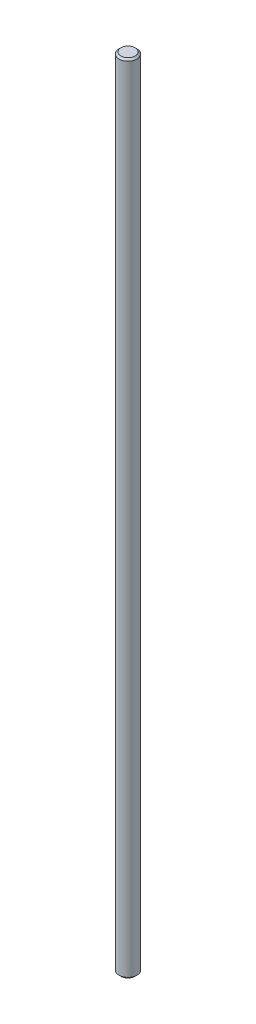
from build123d import *

# Parameters (mm, degrees)
SKETCH1_R      = 2
EXTRUDE1_DEPTH = 178
CHAMFER1_SIZE  = 0.4


with BuildPart() as part:
    # Sketch1 → Extrude1 (new body)
    with BuildSketch(Plane(origin=(0, 0, 0), x_dir=(1, 0, 0), z_dir=(0, 1, 0))):
        with Locations(Location((0, 0, 0), (0, 0, 270))):
            Circle(SKETCH1_R)
    extrude(amount=EXTRUDE1_DEPTH)

    # Chamfer1
    chamfer1_edges = [part.edges().sort_by_distance(p)[0] for p in [
        (0, 0, -2),
        (0, 178, -2),
    ]]
    chamfer(chamfer1_edges, length=CHAMFER1_SIZE)


solid = part.part
